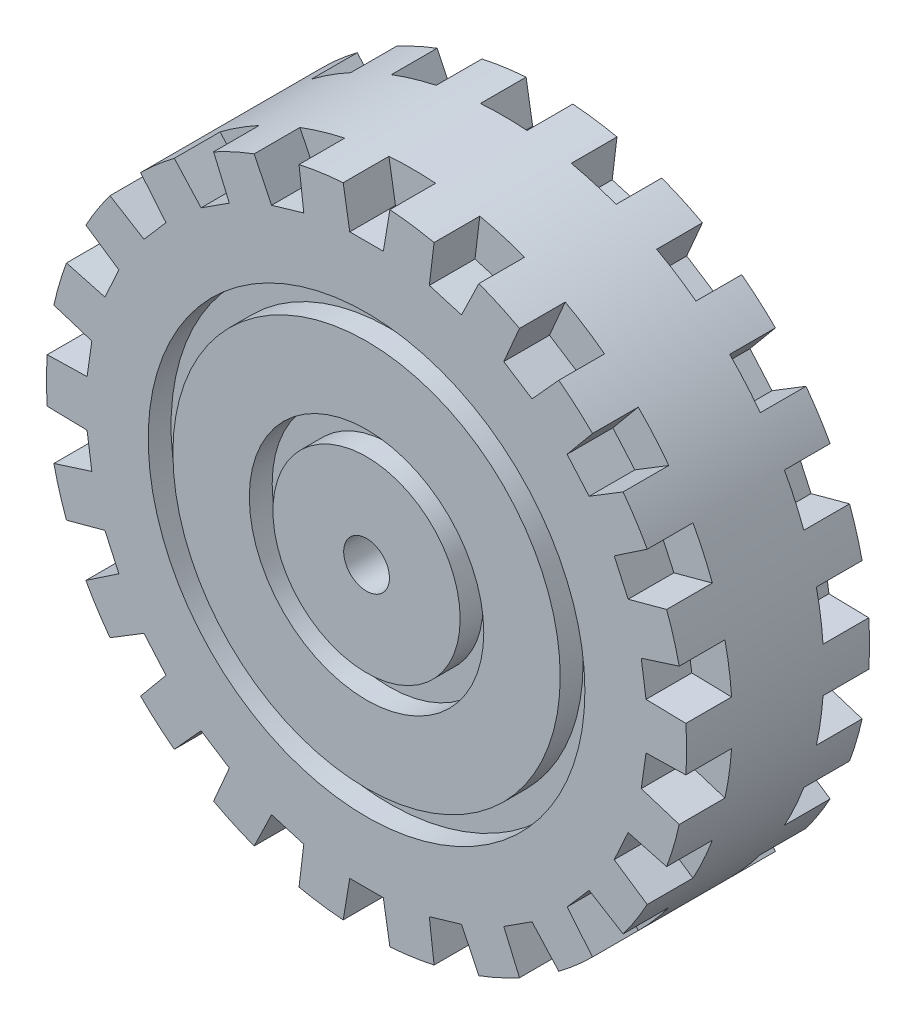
from build123d import *

# Parameters (mm, degrees)
SKETCH1_R      = 28
SKETCH1_R_2    = 2
EXTRUDE1_DEPTH = 8
EXTRUDE2_DEPTH = 4
EXTRUDE3_DEPTH = 10
SKETCH4_R      = 19.100249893
SKETCH4_R_2    = 16.942141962
SKETCH4_R_3    = 10.254692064
SKETCH4_R_4    = 8.19065726
EXTRUDE4_DEPTH = 2


with BuildPart() as part:
    # Sketch1 → Extrude1 (new, symmetric)
    with BuildSketch(Plane.XY):
        Circle(SKETCH1_R)
        Circle(SKETCH1_R_2, mode=Mode.SUBTRACT)
    extrude(amount=EXTRUDE1_DEPTH, both=True)

    # Sketch2 → Extrude2 (cut)
    with BuildSketch(Plane.XY.offset(8)):
        Polygon((-1.469293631, 24.488227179), (1.469293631, 24.488227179), (2.298125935, 29.461221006), (-2.298125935, 29.461221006), align=None)
        Polygon((5.489353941, 23.910229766), (6.095149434, 28.915291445), (10.505220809, 27.620377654), (8.308907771, 23.082334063), align=None)
        Polygon((12.003286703, 21.395167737), (13.994632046, 26.026816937), (17.86124517, 23.541895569), (14.475383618, 19.806447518), align=None)
        Polygon((17.544784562, 17.14679646), (20.760352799, 21.029804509), (23.770257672, 17.556189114), (19.469149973, 14.925960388), align=None)
        Polygon((21.664908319, 11.509293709), (25.844193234, 14.329082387), (27.753545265, 10.148184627), (22.885641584, 8.836260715), align=None)
        Polygon((24.02987005, 4.939376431), (28.834290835, 6.46750323), (29.488405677, 1.918034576), (24.448074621, 2.03069975), align=None)
        Polygon((24.448074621, -2.03069975), (29.488405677, -1.918034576), (28.834290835, -6.46750323), (24.02987005, -4.939376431), align=None)
        Polygon((22.885641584, -8.836260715), (27.753545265, -10.148184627), (25.844193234, -14.329082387), (21.664908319, -11.509293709), align=None)
        Polygon((19.469149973, -14.925960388), (23.770257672, -17.556189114), (20.760352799, -21.029804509), (17.544784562, -17.14679646), align=None)
        Polygon((14.475383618, -19.806447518), (17.86124517, -23.541895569), (13.994632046, -26.026816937), (12.003286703, -21.395167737), align=None)
        Polygon((8.308907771, -23.082334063), (10.505220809, -27.620377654), (6.095149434, -28.915291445), (5.489353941, -23.910229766), align=None)
        Polygon((1.469293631, -24.488227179), (2.298125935, -29.461221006), (-2.298125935, -29.461221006), (-1.469293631, -24.488227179), align=None)
        Polygon((-5.489353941, -23.910229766), (-6.095149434, -28.915291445), (-10.505220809, -27.620377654), (-8.308907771, -23.082334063), align=None)
        Polygon((-12.003286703, -21.395167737), (-13.994632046, -26.026816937), (-17.86124517, -23.541895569), (-14.475383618, -19.806447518), align=None)
        Polygon((-17.544784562, -17.14679646), (-20.760352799, -21.029804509), (-23.770257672, -17.556189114), (-19.469149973, -14.925960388), align=None)
        Polygon((-21.664908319, -11.509293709), (-25.844193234, -14.329082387), (-27.753545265, -10.148184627), (-22.885641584, -8.836260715), align=None)
        Polygon((-24.02987005, -4.939376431), (-28.834290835, -6.46750323), (-29.488405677, -1.918034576), (-24.448074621, -2.03069975), align=None)
        Polygon((-24.448074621, 2.03069975), (-29.488405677, 1.918034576), (-28.834290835, 6.46750323), (-24.02987005, 4.939376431), align=None)
        Polygon((-22.885641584, 8.836260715), (-27.753545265, 10.148184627), (-25.844193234, 14.329082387), (-21.664908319, 11.509293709), align=None)
        Polygon((-19.469149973, 14.925960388), (-23.770257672, 17.556189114), (-20.760352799, 21.029804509), (-17.544784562, 17.14679646), align=None)
        Polygon((-14.475383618, 19.806447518), (-17.86124517, 23.541895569), (-13.994632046, 26.026816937), (-12.003286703, 21.395167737), align=None)
        Polygon((-8.308907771, 23.082334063), (-10.505220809, 27.620377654), (-6.095149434, 28.915291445), (-5.489353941, 23.910229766), align=None)
    extrude2 = extrude(amount=-EXTRUDE2_DEPTH, mode=Mode.SUBTRACT)

    # Mirror1: Extrude2 across plane
    add(extrude2.mirror(Plane.XY), mode=Mode.SUBTRACT)

    # Sketch3 → Extrude3 (cut)
    with BuildSketch(Plane(origin=(0, 0, -8), x_dir=(-1, 0, 0), z_dir=(0, 0, -1))):
        with BuildLine():
            Line((2.074242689, 3.742032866), (11.000892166, 19.846134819))
            ThreePointArc((11.000892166, 19.846134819), (0, 22.691158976), (-11.000892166, 19.846134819))
            Line((-11.000892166, 19.846134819), (-2.074242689, 3.742032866))
            ThreePointArc((-2.074242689, 3.742032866), (0, 4.2784685), (2.074242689, 3.742032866))
        make_face()
        with BuildLine():
            Line((4.277816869, 0.074669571), (22.687703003, 0.396015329))
            ThreePointArc((22.687703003, 0.396015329), (19.651120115, 11.345579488), (11.686810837, 19.45011949))
            Line((11.686810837, 19.45011949), (2.20357418, 3.667363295))
            ThreePointArc((2.20357418, 3.667363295), (3.70526241, 2.13923425), (4.277816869, 0.074669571))
        make_face()
        with BuildLine():
            Line((2.20357418, -3.667363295), (11.686810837, -19.45011949))
            ThreePointArc((11.686810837, -19.45011949), (19.651120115, -11.345579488), (22.687703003, -0.396015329))
            Line((22.687703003, -0.396015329), (4.277816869, -0.074669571))
            ThreePointArc((4.277816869, -0.074669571), (3.70526241, -2.13923425), (2.20357418, -3.667363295))
        make_face()
        with BuildLine():
            Line((-2.074242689, -3.742032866), (-11.000892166, -19.846134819))
            ThreePointArc((-11.000892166, -19.846134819), (0, -22.691158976), (11.000892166, -19.846134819))
            Line((11.000892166, -19.846134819), (2.074242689, -3.742032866))
            ThreePointArc((2.074242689, -3.742032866), (0, -4.2784685), (-2.074242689, -3.742032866))
        make_face()
        with BuildLine():
            Line((-4.277816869, -0.074669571), (-22.687703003, -0.396015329))
            ThreePointArc((-22.687703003, -0.396015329), (-19.651120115, -11.345579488), (-11.686810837, -19.45011949))
            Line((-11.686810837, -19.45011949), (-2.20357418, -3.667363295))
            ThreePointArc((-2.20357418, -3.667363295), (-3.70526241, -2.13923425), (-4.277816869, -0.074669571))
        make_face()
        with BuildLine():
            Line((-2.20357418, 3.667363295), (-11.686810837, 19.45011949))
            ThreePointArc((-11.686810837, 19.45011949), (-19.651120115, 11.345579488), (-22.687703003, 0.396015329))
            Line((-22.687703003, 0.396015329), (-4.277816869, 0.074669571))
            ThreePointArc((-4.277816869, 0.074669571), (-3.70526241, 2.13923425), (-2.20357418, 3.667363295))
        make_face()
    extrude(amount=-EXTRUDE3_DEPTH, mode=Mode.SUBTRACT)

    # Sketch4 → Extrude4 (cut)
    # profile 1 of 2: a face of its own
    with BuildSketch(Plane.XY.offset(8)):
        Circle(SKETCH4_R)
        Circle(SKETCH4_R_2, mode=Mode.SUBTRACT)
    # profile 2 of 2: a face of its own
    with BuildSketch(Plane.XY.offset(8)):
        Circle(SKETCH4_R_3)
        Circle(SKETCH4_R_4, mode=Mode.SUBTRACT)
    extrude(amount=-EXTRUDE4_DEPTH, mode=Mode.SUBTRACT)


solid = part.part
